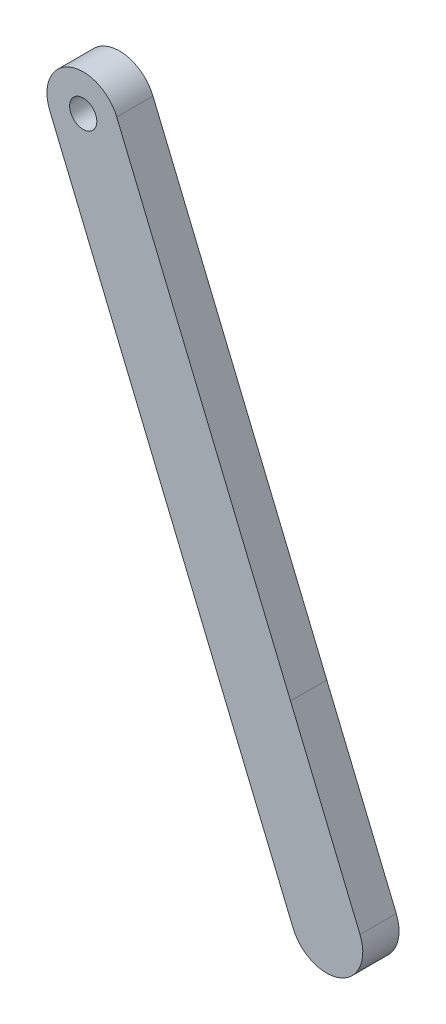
from build123d import *

# Parameters (mm, degrees)
SKETCH_1_R      = 1.5
EXTRUDE_1_DEPTH = 4


with BuildPart() as part:
    # Sketch 1 → Extrude 1 (new body)
    with BuildSketch(Plane.XY):
        with BuildLine():
            Line((-4.113023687, -24.624043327), (3.552513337, -43.096837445))
            ThreePointArc((3.552513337, -43.096837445), (8.780563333, -45.258450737), (10.942182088, -40.030402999))
            Line((10.942182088, -40.030402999), (3.27669304, -21.557615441))
            Line((3.27669304, -21.557615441), (-15.887322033, 24.623988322))
            ThreePointArc((-15.887322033, 24.623988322), (-21.114958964, 26.785400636), (-23.276389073, 21.557771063))
            Line((-23.276389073, 21.557771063), (-13.694538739, -1.533096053))
            Line((-13.694538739, -1.533096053), (-4.113023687, -24.624043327))
        make_face()
        with Locations((-19.581850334, 23.090867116)):
            Circle(SKETCH_1_R, mode=Mode.SUBTRACT)
    extrude(amount=EXTRUDE_1_DEPTH)


solid = part.part
